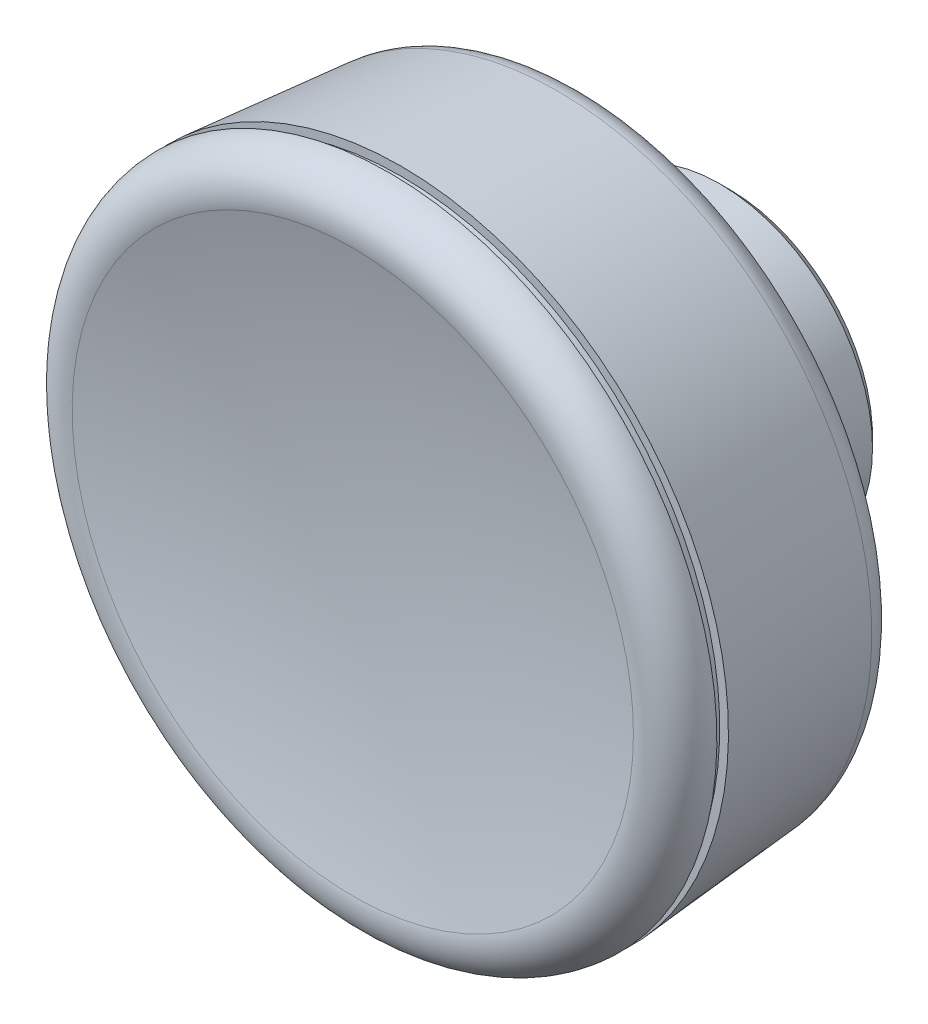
ISO-10303-21;
HEADER;
FILE_DESCRIPTION(('STEP AP214'),'2;1');
FILE_NAME('part.step','',(''),(''),'','','');
FILE_SCHEMA(('AUTOMOTIVE_DESIGN { 1 0 10303 214 1 1 1 1 }'));
ENDSEC;
DATA;
#1=APPLICATION_CONTEXT('core data for automotive mechanical design processes');
#2=APPLICATION_PROTOCOL_DEFINITION('international standard','automotive_design',2000,#1);
#3=PRODUCT_CONTEXT('',#1,'mechanical');
#4=PRODUCT('Part','Part','',(#3));
#5=PRODUCT_RELATED_PRODUCT_CATEGORY('part','',(#4));
#6=PRODUCT_DEFINITION_FORMATION('','',#4);
#7=PRODUCT_DEFINITION_CONTEXT('part definition',#1,'design');
#8=PRODUCT_DEFINITION('design','',#6,#7);
#9=PRODUCT_DEFINITION_SHAPE('','',#8);
#10=(LENGTH_UNIT() NAMED_UNIT(*) SI_UNIT(.MILLI.,.METRE.));
#11=(NAMED_UNIT(*) PLANE_ANGLE_UNIT() SI_UNIT($,.RADIAN.));
#12=(NAMED_UNIT(*) SI_UNIT($,.STERADIAN.) SOLID_ANGLE_UNIT());
#13=UNCERTAINTY_MEASURE_WITH_UNIT(LENGTH_MEASURE(1.E-05),#10,'distance_accuracy_value','');
#14=(GEOMETRIC_REPRESENTATION_CONTEXT(3) GLOBAL_UNCERTAINTY_ASSIGNED_CONTEXT((#13)) GLOBAL_UNIT_ASSIGNED_CONTEXT((#10,
#11,#12)) REPRESENTATION_CONTEXT('',''));
#15=CARTESIAN_POINT('',(0.,0.,0.));
#16=DIRECTION('',(0.,0.,1.));
#17=DIRECTION('',(1.,0.,0.));
#18=AXIS2_PLACEMENT_3D('',#15,#16,#17);
#19=CARTESIAN_POINT('',(0.,0.,106.143396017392));
#20=DIRECTION('',(0.,0.,-1.));
#21=DIRECTION('',(1.,0.,0.));
#22=AXIS2_PLACEMENT_3D('',#19,#20,#21);
#23=SPHERICAL_SURFACE('',#22,82.5);
#24=CARTESIAN_POINT('',(0.,0.,25.9307460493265));
#25=DIRECTION('',(0.,0.,-1.));
#26=DIRECTION('',(0.,1.,0.));
#27=AXIS2_PLACEMENT_3D('',#24,#25,#26);
#28=CIRCLE('',#27,19.2919875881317);
#29=CARTESIAN_POINT('',(0.,19.2919875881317,25.9307460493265));
#30=VERTEX_POINT('',#29);
#31=EDGE_CURVE('E49',#30,#30,#28,.T.);
#32=ORIENTED_EDGE('',*,*,#31,.F.);
#33=EDGE_LOOP('',(#32));
#34=FACE_BOUND('',#33,.T.);
#35=ADVANCED_FACE('F12',(#34),#23,.F.);
#36=CARTESIAN_POINT('',(9.79676461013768,0.,0.));
#37=DIRECTION('',(0.,0.,-1.));
#38=DIRECTION('',(0.,1.,0.));
#39=AXIS2_PLACEMENT_3D('',#36,#37,#38);
#40=PLANE('',#39);
#41=CARTESIAN_POINT('',(0.,0.,0.));
#42=DIRECTION('',(0.,0.,-1.));
#43=DIRECTION('',(0.,1.,0.));
#44=AXIS2_PLACEMENT_3D('',#41,#42,#43);
#45=CIRCLE('',#44,4.);
#46=CARTESIAN_POINT('',(0.,4.,0.));
#47=VERTEX_POINT('',#46);
#48=EDGE_CURVE('E55',#47,#47,#45,.T.);
#49=ORIENTED_EDGE('',*,*,#48,.F.);
#50=EDGE_LOOP('',(#49));
#51=FACE_BOUND('',#50,.T.);
#52=CARTESIAN_POINT('',(0.,0.,0.));
#53=DIRECTION('',(0.,0.,-1.));
#54=DIRECTION('',(0.,1.,0.));
#55=AXIS2_PLACEMENT_3D('',#52,#53,#54);
#56=CIRCLE('',#55,9.79676461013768);
#57=CARTESIAN_POINT('',(0.,9.79676461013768,0.));
#58=VERTEX_POINT('',#57);
#59=EDGE_CURVE('E8',#58,#58,#56,.T.);
#60=ORIENTED_EDGE('',*,*,#59,.T.);
#61=EDGE_LOOP('',(#60));
#62=FACE_BOUND('',#61,.T.);
#63=ADVANCED_FACE('F61',(#51,#62),#40,.T.);
#64=CARTESIAN_POINT('',(0.,0.,0.));
#65=DIRECTION('',(0.,0.,1.));
#66=DIRECTION('',(0.,-1.,0.));
#67=AXIS2_PLACEMENT_3D('',#64,#65,#66);
#68=CONICAL_SURFACE('',#67,9.79676461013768,0.785398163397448);
#69=CARTESIAN_POINT('',(0.,0.,0.700000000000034));
#70=DIRECTION('',(0.,0.,-1.));
#71=DIRECTION('',(0.,1.,0.));
#72=AXIS2_PLACEMENT_3D('',#69,#70,#71);
#73=CIRCLE('',#72,10.4967646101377);
#74=CARTESIAN_POINT('',(0.,10.4967646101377,0.700000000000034));
#75=VERTEX_POINT('',#74);
#76=EDGE_CURVE('E18',#75,#75,#73,.T.);
#77=ORIENTED_EDGE('',*,*,#76,.T.);
#78=EDGE_LOOP('',(#77));
#79=FACE_BOUND('',#78,.T.);
#80=ORIENTED_EDGE('',*,*,#59,.F.);
#81=EDGE_LOOP('',(#80));
#82=FACE_BOUND('',#81,.T.);
#83=ADVANCED_FACE('F63',(#79,#82),#68,.T.);
#84=CARTESIAN_POINT('',(0.,0.,0.));
#85=DIRECTION('',(0.,0.,-1.));
#86=DIRECTION('',(0.,1.,0.));
#87=AXIS2_PLACEMENT_3D('',#84,#85,#86);
#88=CYLINDRICAL_SURFACE('',#87,10.4967646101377);
#89=CARTESIAN_POINT('',(0.,0.,9.06177687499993));
#90=DIRECTION('',(0.,0.,-1.));
#91=DIRECTION('',(0.,1.,0.));
#92=AXIS2_PLACEMENT_3D('',#89,#90,#91);
#93=CIRCLE('',#92,10.4967646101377);
#94=CARTESIAN_POINT('',(0.,10.4967646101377,9.06177687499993));
#95=VERTEX_POINT('',#94);
#96=EDGE_CURVE('E22',#95,#95,#93,.T.);
#97=ORIENTED_EDGE('',*,*,#96,.T.);
#98=EDGE_LOOP('',(#97));
#99=FACE_BOUND('',#98,.T.);
#100=ORIENTED_EDGE('',*,*,#76,.F.);
#101=EDGE_LOOP('',(#100));
#102=FACE_BOUND('',#101,.T.);
#103=ADVANCED_FACE('F70',(#99,#102),#88,.T.);
#104=CARTESIAN_POINT('',(0.,0.,9.06177687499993));
#105=DIRECTION('',(0.,0.,-1.));
#106=DIRECTION('',(0.,1.,0.));
#107=AXIS2_PLACEMENT_3D('',#104,#105,#106);
#108=TOROIDAL_SURFACE('',#107,11.4342646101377,0.937500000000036);
#109=CARTESIAN_POINT('',(0.,0.,9.99927687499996));
#110=DIRECTION('',(0.,0.,-1.));
#111=DIRECTION('',(0.,1.,0.));
#112=AXIS2_PLACEMENT_3D('',#109,#110,#111);
#113=CIRCLE('',#112,11.4342646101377);
#114=CARTESIAN_POINT('',(0.,11.4342646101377,9.99927687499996));
#115=VERTEX_POINT('',#114);
#116=EDGE_CURVE('E26',#115,#115,#113,.T.);
#117=ORIENTED_EDGE('',*,*,#116,.T.);
#118=EDGE_LOOP('',(#117));
#119=FACE_BOUND('',#118,.T.);
#120=ORIENTED_EDGE('',*,*,#96,.F.);
#121=EDGE_LOOP('',(#120));
#122=FACE_BOUND('',#121,.T.);
#123=ADVANCED_FACE('F76',(#119,#122),#108,.F.);
#124=CARTESIAN_POINT('',(11.4342646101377,0.,9.99927687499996));
#125=DIRECTION('',(0.,0.,-1.));
#126=DIRECTION('',(0.,1.,0.));
#127=AXIS2_PLACEMENT_3D('',#124,#125,#126);
#128=PLANE('',#127);
#129=CARTESIAN_POINT('',(0.,0.,9.99927687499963));
#130=DIRECTION('',(0.,0.,-1.));
#131=DIRECTION('',(0.,1.,0.));
#132=AXIS2_PLACEMENT_3D('',#129,#130,#131);
#133=CIRCLE('',#132,19.5827925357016);
#134=CARTESIAN_POINT('',(0.,19.5827925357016,9.99927687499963));
#135=VERTEX_POINT('',#134);
#136=EDGE_CURVE('E31',#135,#135,#133,.T.);
#137=ORIENTED_EDGE('',*,*,#136,.T.);
#138=EDGE_LOOP('',(#137));
#139=FACE_BOUND('',#138,.T.);
#140=ORIENTED_EDGE('',*,*,#116,.F.);
#141=EDGE_LOOP('',(#140));
#142=FACE_BOUND('',#141,.T.);
#143=ADVANCED_FACE('F80',(#139,#142),#128,.T.);
#144=CARTESIAN_POINT('',(0.,0.,12.0082034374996));
#145=DIRECTION('',(0.,0.,-1.));
#146=DIRECTION('',(0.,1.,0.));
#147=AXIS2_PLACEMENT_3D('',#144,#145,#146);
#148=TOROIDAL_SURFACE('',#147,19.5827925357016,2.00892656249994);
#149=CARTESIAN_POINT('',(0.,0.,11.8381158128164));
#150=DIRECTION('',(0.,0.,-1.));
#151=DIRECTION('',(0.,1.,0.));
#152=AXIS2_PLACEMENT_3D('',#149,#150,#151);
#153=CIRCLE('',#152,21.5845058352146);
#154=CARTESIAN_POINT('',(0.,21.5845058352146,11.8381158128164));
#155=VERTEX_POINT('',#154);
#156=EDGE_CURVE('E34',#155,#155,#153,.T.);
#157=ORIENTED_EDGE('',*,*,#156,.T.);
#158=EDGE_LOOP('',(#157));
#159=FACE_BOUND('',#158,.T.);
#160=ORIENTED_EDGE('',*,*,#136,.F.);
#161=EDGE_LOOP('',(#160));
#162=FACE_BOUND('',#161,.T.);
#163=ADVANCED_FACE('F84',(#159,#162),#148,.T.);
#164=CARTESIAN_POINT('',(0.,0.,11.8381158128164));
#165=DIRECTION('',(0.,0.,1.));
#166=DIRECTION('',(0.,-1.,0.));
#167=AXIS2_PLACEMENT_3D('',#164,#165,#166);
#168=CONICAL_SURFACE('',#167,21.5845058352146,0.0847674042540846);
#169=CARTESIAN_POINT('',(0.,0.,22.605690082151));
#170=DIRECTION('',(0.,0.,-1.));
#171=DIRECTION('',(0.,1.,0.));
#172=AXIS2_PLACEMENT_3D('',#169,#170,#171);
#173=CIRCLE('',#172,22.4994376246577);
#174=CARTESIAN_POINT('',(0.,22.4994376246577,22.605690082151));
#175=VERTEX_POINT('',#174);
#176=EDGE_CURVE('E37',#175,#175,#173,.T.);
#177=ORIENTED_EDGE('',*,*,#176,.T.);
#178=EDGE_LOOP('',(#177));
#179=FACE_BOUND('',#178,.T.);
#180=ORIENTED_EDGE('',*,*,#156,.F.);
#181=EDGE_LOOP('',(#180));
#182=FACE_BOUND('',#181,.T.);
#183=ADVANCED_FACE('F88',(#179,#182),#168,.T.);
#184=CARTESIAN_POINT('',(21.9,0.,22.605690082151));
#185=DIRECTION('',(0.,0.,1.));
#186=DIRECTION('',(0.,-1.,0.));
#187=AXIS2_PLACEMENT_3D('',#184,#185,#186);
#188=PLANE('',#187);
#189=CARTESIAN_POINT('',(0.,0.,22.605690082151));
#190=DIRECTION('',(0.,0.,-1.));
#191=DIRECTION('',(0.,1.,0.));
#192=AXIS2_PLACEMENT_3D('',#189,#190,#191);
#193=CIRCLE('',#192,21.9);
#194=CARTESIAN_POINT('',(0.,21.9,22.605690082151));
#195=VERTEX_POINT('',#194);
#196=EDGE_CURVE('E40',#195,#195,#193,.T.);
#197=ORIENTED_EDGE('',*,*,#196,.T.);
#198=EDGE_LOOP('',(#197));
#199=FACE_BOUND('',#198,.T.);
#200=ORIENTED_EDGE('',*,*,#176,.F.);
#201=EDGE_LOOP('',(#200));
#202=FACE_BOUND('',#201,.T.);
#203=ADVANCED_FACE('F92',(#199,#202),#188,.T.);
#204=CARTESIAN_POINT('',(0.,0.,0.));
#205=DIRECTION('',(0.,0.,-1.));
#206=DIRECTION('',(0.,1.,0.));
#207=AXIS2_PLACEMENT_3D('',#204,#205,#206);
#208=CYLINDRICAL_SURFACE('',#207,21.9);
#209=CARTESIAN_POINT('',(0.,0.,23.402832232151));
#210=DIRECTION('',(0.,0.,-1.));
#211=DIRECTION('',(0.,1.,0.));
#212=AXIS2_PLACEMENT_3D('',#209,#210,#211);
#213=CIRCLE('',#212,21.9);
#214=CARTESIAN_POINT('',(0.,21.9,23.402832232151));
#215=VERTEX_POINT('',#214);
#216=EDGE_CURVE('E43',#215,#215,#213,.T.);
#217=ORIENTED_EDGE('',*,*,#216,.T.);
#218=EDGE_LOOP('',(#217));
#219=FACE_BOUND('',#218,.T.);
#220=ORIENTED_EDGE('',*,*,#196,.F.);
#221=EDGE_LOOP('',(#220));
#222=FACE_BOUND('',#221,.T.);
#223=ADVANCED_FACE('F96',(#219,#222),#208,.T.);
#224=CARTESIAN_POINT('',(21.9,0.,23.402832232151));
#225=DIRECTION('',(0.,0.,-1.));
#226=DIRECTION('',(0.,1.,0.));
#227=AXIS2_PLACEMENT_3D('',#224,#225,#226);
#228=PLANE('',#227);
#229=CARTESIAN_POINT('',(0.,0.,23.402832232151));
#230=DIRECTION('',(0.,0.,-1.));
#231=DIRECTION('',(0.,1.,0.));
#232=AXIS2_PLACEMENT_3D('',#229,#230,#231);
#233=CIRCLE('',#232,22.4999775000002);
#234=CARTESIAN_POINT('',(0.,22.4999775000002,23.402832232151));
#235=VERTEX_POINT('',#234);
#236=EDGE_CURVE('E46',#235,#235,#233,.T.);
#237=ORIENTED_EDGE('',*,*,#236,.T.);
#238=EDGE_LOOP('',(#237));
#239=FACE_BOUND('',#238,.T.);
#240=ORIENTED_EDGE('',*,*,#216,.F.);
#241=EDGE_LOOP('',(#240));
#242=FACE_BOUND('',#241,.T.);
#243=ADVANCED_FACE('F100',(#239,#242),#228,.T.);
#244=CARTESIAN_POINT('',(0.,0.,23.402832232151));
#245=DIRECTION('',(0.,0.,-1.));
#246=DIRECTION('',(0.,1.,0.));
#247=AXIS2_PLACEMENT_3D('',#244,#245,#246);
#248=TOROIDAL_SURFACE('',#247,19.8999775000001,2.60000000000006);
#249=ORIENTED_EDGE('',*,*,#31,.T.);
#250=EDGE_LOOP('',(#249));
#251=FACE_BOUND('',#250,.T.);
#252=ORIENTED_EDGE('',*,*,#236,.F.);
#253=EDGE_LOOP('',(#252));
#254=FACE_BOUND('',#253,.T.);
#255=ADVANCED_FACE('F104',(#251,#254),#248,.T.);
#256=CARTESIAN_POINT('',(0.,0.,13.));
#257=DIRECTION('',(0.,0.,-1.));
#258=DIRECTION('',(0.,1.,0.));
#259=AXIS2_PLACEMENT_3D('',#256,#257,#258);
#260=CYLINDRICAL_SURFACE('',#259,4.);
#261=CARTESIAN_POINT('',(0.,0.,13.));
#262=DIRECTION('',(0.,0.,-1.));
#263=DIRECTION('',(0.,1.,0.));
#264=AXIS2_PLACEMENT_3D('',#261,#262,#263);
#265=CIRCLE('',#264,4.);
#266=CARTESIAN_POINT('',(0.,4.,13.));
#267=VERTEX_POINT('',#266);
#268=EDGE_CURVE('E52',#267,#267,#265,.T.);
#269=ORIENTED_EDGE('',*,*,#268,.F.);
#270=EDGE_LOOP('',(#269));
#271=FACE_BOUND('',#270,.T.);
#272=ORIENTED_EDGE('',*,*,#48,.T.);
#273=EDGE_LOOP('',(#272));
#274=FACE_BOUND('',#273,.T.);
#275=ADVANCED_FACE('F59',(#271,#274),#260,.F.);
#276=CARTESIAN_POINT('',(0.,0.,13.));
#277=DIRECTION('',(0.,0.,-1.));
#278=DIRECTION('',(0.,1.,0.));
#279=AXIS2_PLACEMENT_3D('',#276,#277,#278);
#280=PLANE('',#279);
#281=ORIENTED_EDGE('',*,*,#268,.T.);
#282=EDGE_LOOP('',(#281));
#283=FACE_BOUND('',#282,.T.);
#284=ADVANCED_FACE('F111',(#283),#280,.T.);
#285=CLOSED_SHELL('',(#35,#63,#83,#103,#123,#143,#163,#183,#203,#223,#243,#255,#275,#284));
#286=MANIFOLD_SOLID_BREP('B1',#285);
#287=ADVANCED_BREP_SHAPE_REPRESENTATION('',(#18,#286),#14);
#288=SHAPE_DEFINITION_REPRESENTATION(#9,#287);
ENDSEC;
END-ISO-10303-21;
